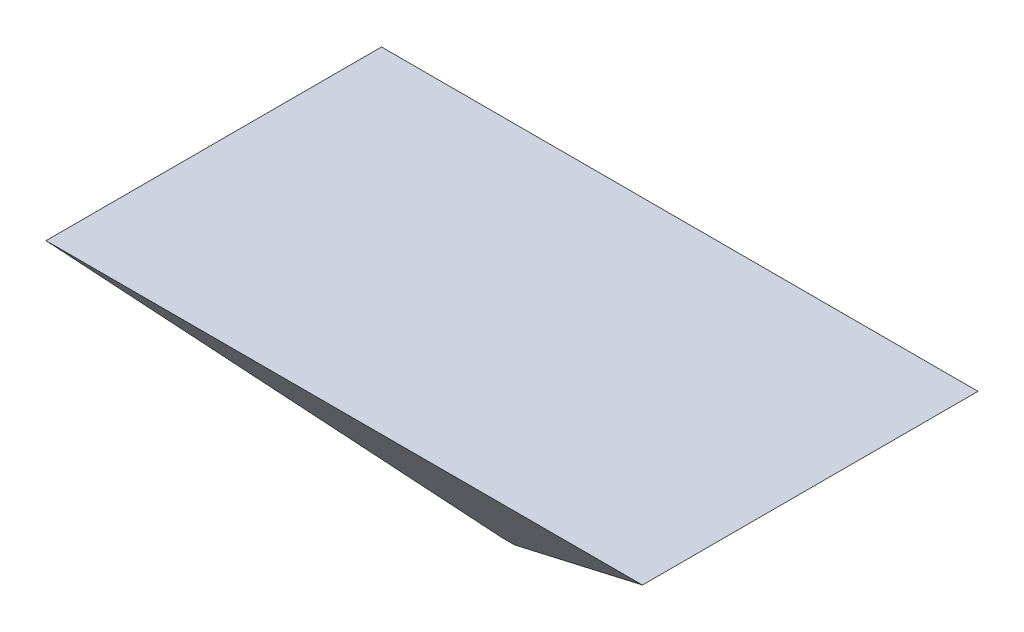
from build123d import *


with BuildPart() as part:
    # Sketch5 → Loft1 section 0
    with BuildSketch(Plane(origin=(0, 50, 0), x_dir=(1, 0, 0), z_dir=(0, 1, 0))):
        with BuildLine():
            Line((-75.480655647, 42.457868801), (75.480655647, 42.457868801))
            Line((75.480655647, 42.457868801), (75.480655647, -42.457868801))
            Line((75.480655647, -42.457868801), (-75.480655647, -42.457868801))
            Line((-75.480655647, -42.457868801), (-75.480655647, 42.457868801))
        make_face()
    # Sketch6 → Loft1 section 1
    with BuildSketch(Plane(origin=(0, 1, 0), x_dir=(1, 0, 0), z_dir=(0, 1, 0))):
        with BuildLine():
            Line((-1.509613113, 0.849157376), (1.509613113, 0.849157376))
            Line((1.509613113, 0.849157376), (1.509613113, -0.849157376))
            Line((1.509613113, -0.849157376), (-1.509613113, -0.849157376))
            Line((-1.509613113, -0.849157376), (-1.509613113, 0.849157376))
        make_face()
    loft()


solid = part.part
